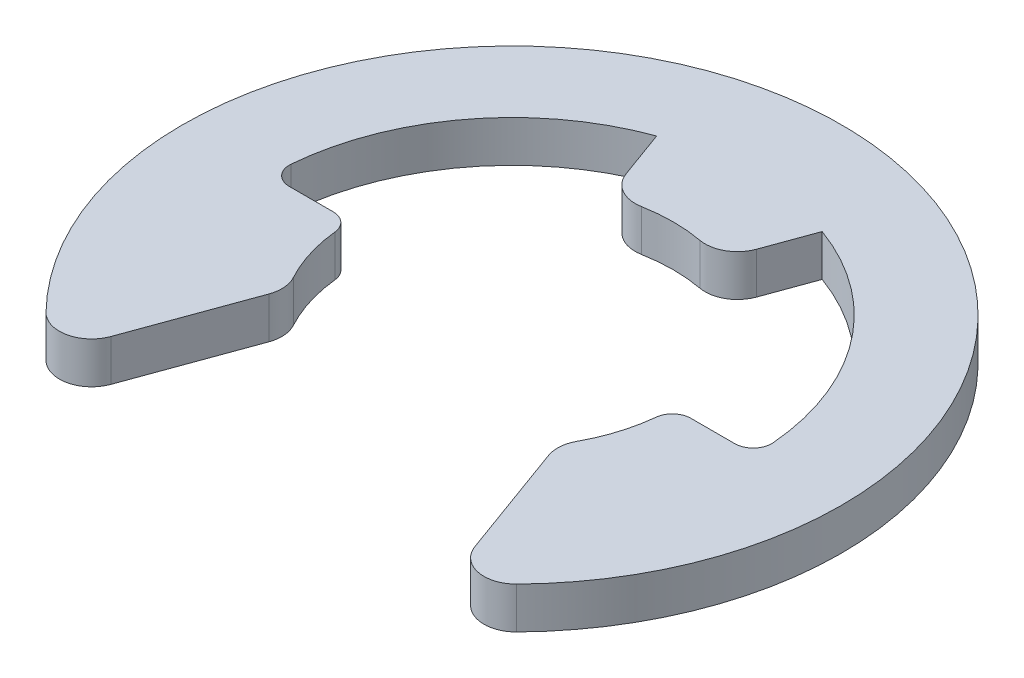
ISO-10303-21;
HEADER;
FILE_DESCRIPTION(('STEP AP214'),'2;1');
FILE_NAME('part.step','',(''),(''),'','','');
FILE_SCHEMA(('AUTOMOTIVE_DESIGN { 1 0 10303 214 1 1 1 1 }'));
ENDSEC;
DATA;
#1=APPLICATION_CONTEXT('core data for automotive mechanical design processes');
#2=APPLICATION_PROTOCOL_DEFINITION('international standard','automotive_design',2000,#1);
#3=PRODUCT_CONTEXT('',#1,'mechanical');
#4=PRODUCT('Part','Part','',(#3));
#5=PRODUCT_RELATED_PRODUCT_CATEGORY('part','',(#4));
#6=PRODUCT_DEFINITION_FORMATION('','',#4);
#7=PRODUCT_DEFINITION_CONTEXT('part definition',#1,'design');
#8=PRODUCT_DEFINITION('design','',#6,#7);
#9=PRODUCT_DEFINITION_SHAPE('','',#8);
#10=(LENGTH_UNIT() NAMED_UNIT(*) SI_UNIT(.MILLI.,.METRE.));
#11=(NAMED_UNIT(*) PLANE_ANGLE_UNIT() SI_UNIT($,.RADIAN.));
#12=(NAMED_UNIT(*) SI_UNIT($,.STERADIAN.) SOLID_ANGLE_UNIT());
#13=UNCERTAINTY_MEASURE_WITH_UNIT(LENGTH_MEASURE(1.E-05),#10,'distance_accuracy_value','');
#14=(GEOMETRIC_REPRESENTATION_CONTEXT(3) GLOBAL_UNCERTAINTY_ASSIGNED_CONTEXT((#13)) GLOBAL_UNIT_ASSIGNED_CONTEXT((#10,
#11,#12)) REPRESENTATION_CONTEXT('',''));
#15=CARTESIAN_POINT('',(0.,0.,0.));
#16=DIRECTION('',(0.,0.,1.));
#17=DIRECTION('',(1.,0.,0.));
#18=AXIS2_PLACEMENT_3D('',#15,#16,#17);
#19=CARTESIAN_POINT('',(0.,0.45,0.));
#20=DIRECTION('',(0.,-1.,0.));
#21=DIRECTION('',(0.,0.,-1.));
#22=AXIS2_PLACEMENT_3D('',#19,#20,#21);
#23=CYLINDRICAL_SURFACE('',#22,5.25);
#24=CARTESIAN_POINT('',(0.,0.45,0.));
#25=DIRECTION('',(0.,-1.,0.));
#26=DIRECTION('',(0.,0.,1.));
#27=AXIS2_PLACEMENT_3D('',#24,#25,#26);
#28=CIRCLE('',#27,5.25);
#29=CARTESIAN_POINT('',(-5.23211428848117,0.45,-0.43298969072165));
#30=VERTEX_POINT('',#29);
#31=CARTESIAN_POINT('',(-1.79560575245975,0.45,-4.93338625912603));
#32=VERTEX_POINT('',#31);
#33=EDGE_CURVE('E187',#30,#32,#28,.T.);
#34=ORIENTED_EDGE('',*,*,#33,.F.);
#35=DIRECTION('',(0.,-1.,0.));
#36=VECTOR('',#35,1.);
#37=CARTESIAN_POINT('',(-5.23211428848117,0.45,-0.43298969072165));
#38=LINE('',#37,#36);
#39=CARTESIAN_POINT('',(-5.23211428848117,-0.45,-0.43298969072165));
#40=VERTEX_POINT('',#39);
#41=EDGE_CURVE('E328',#30,#40,#38,.T.);
#42=ORIENTED_EDGE('',*,*,#41,.T.);
#43=CARTESIAN_POINT('',(0.,-0.45,0.));
#44=DIRECTION('',(0.,-1.,0.));
#45=DIRECTION('',(0.,0.,1.));
#46=AXIS2_PLACEMENT_3D('',#43,#44,#45);
#47=CIRCLE('',#46,5.25);
#48=CARTESIAN_POINT('',(-1.79560575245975,-0.45,-4.93338625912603));
#49=VERTEX_POINT('',#48);
#50=EDGE_CURVE('E211',#40,#49,#47,.T.);
#51=ORIENTED_EDGE('',*,*,#50,.T.);
#52=DIRECTION('',(0.,-1.,0.));
#53=VECTOR('',#52,1.);
#54=CARTESIAN_POINT('',(-1.79560575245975,0.45,-4.93338625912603));
#55=LINE('',#54,#53);
#56=EDGE_CURVE('E204',#32,#49,#55,.T.);
#57=ORIENTED_EDGE('',*,*,#56,.F.);
#58=EDGE_LOOP('',(#34,#42,#51,#57));
#59=FACE_BOUND('',#58,.T.);
#60=ADVANCED_FACE('F39',(#59),#23,.F.);
#61=CARTESIAN_POINT('',(-1.79560575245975,0.45,-4.93338625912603));
#62=DIRECTION('',(0.939692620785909,0.,-0.342020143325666));
#63=DIRECTION('',(-0.342020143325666,0.,-0.939692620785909));
#64=AXIS2_PLACEMENT_3D('',#61,#62,#63);
#65=PLANE('',#64);
#66=DIRECTION('',(0.342020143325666,0.,0.939692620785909));
#67=VECTOR('',#66,1.);
#68=CARTESIAN_POINT('',(-1.79560575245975,-0.45,-4.93338625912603));
#69=LINE('',#68,#67);
#70=CARTESIAN_POINT('',(-1.41639291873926,-0.45,-3.89150756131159));
#71=VERTEX_POINT('',#70);
#72=EDGE_CURVE('E447',#49,#71,#69,.T.);
#73=ORIENTED_EDGE('',*,*,#72,.T.);
#74=DIRECTION('',(0.,-1.,0.));
#75=VECTOR('',#74,1.);
#76=CARTESIAN_POINT('',(-1.41639291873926,0.45,-3.89150756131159));
#77=LINE('',#76,#75);
#78=CARTESIAN_POINT('',(-1.41639291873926,0.45,-3.89150756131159));
#79=VERTEX_POINT('',#78);
#80=EDGE_CURVE('E206',#71,#79,#77,.F.);
#81=ORIENTED_EDGE('',*,*,#80,.T.);
#82=DIRECTION('',(0.342020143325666,0.,0.939692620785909));
#83=VECTOR('',#82,1.);
#84=CARTESIAN_POINT('',(-1.79560575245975,0.45,-4.93338625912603));
#85=LINE('',#84,#83);
#86=EDGE_CURVE('E191',#32,#79,#85,.T.);
#87=ORIENTED_EDGE('',*,*,#86,.F.);
#88=ORIENTED_EDGE('',*,*,#56,.T.);
#89=EDGE_LOOP('',(#73,#81,#87,#88));
#90=FACE_BOUND('',#89,.T.);
#91=ADVANCED_FACE('F203',(#90),#65,.F.);
#92=CARTESIAN_POINT('',(0.,0.45,0.));
#93=DIRECTION('',(0.,-1.,0.));
#94=DIRECTION('',(0.,0.,-1.));
#95=AXIS2_PLACEMENT_3D('',#92,#93,#94);
#96=CYLINDRICAL_SURFACE('',#95,3.5);
#97=CARTESIAN_POINT('',(0.,-0.45,0.));
#98=DIRECTION('',(0.,-1.,0.));
#99=DIRECTION('',(0.,0.,1.));
#100=AXIS2_PLACEMENT_3D('',#97,#98,#99);
#101=CIRCLE('',#100,3.5);
#102=CARTESIAN_POINT('',(-0.632173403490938,-0.45,-3.44243471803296));
#103=VERTEX_POINT('',#102);
#104=CARTESIAN_POINT('',(0.632173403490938,-0.45,-3.44243471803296));
#105=VERTEX_POINT('',#104);
#106=EDGE_CURVE('E450',#103,#105,#101,.T.);
#107=ORIENTED_EDGE('',*,*,#106,.T.);
#108=DIRECTION('',(0.,-1.,0.));
#109=VECTOR('',#108,1.);
#110=CARTESIAN_POINT('',(0.632173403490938,0.45,-3.44243471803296));
#111=LINE('',#110,#109);
#112=CARTESIAN_POINT('',(0.632173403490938,0.45,-3.44243471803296));
#113=VERTEX_POINT('',#112);
#114=EDGE_CURVE('E291',#105,#113,#111,.F.);
#115=ORIENTED_EDGE('',*,*,#114,.T.);
#116=CARTESIAN_POINT('',(0.,0.45,0.));
#117=DIRECTION('',(0.,-1.,0.));
#118=DIRECTION('',(0.,0.,1.));
#119=AXIS2_PLACEMENT_3D('',#116,#117,#118);
#120=CIRCLE('',#119,3.5);
#121=CARTESIAN_POINT('',(-0.632173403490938,0.45,-3.44243471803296));
#122=VERTEX_POINT('',#121);
#123=EDGE_CURVE('E208',#122,#113,#120,.T.);
#124=ORIENTED_EDGE('',*,*,#123,.F.);
#125=DIRECTION('',(0.,-1.,0.));
#126=VECTOR('',#125,1.);
#127=CARTESIAN_POINT('',(-0.632173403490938,0.45,-3.44243471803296));
#128=LINE('',#127,#126);
#129=EDGE_CURVE('E287',#122,#103,#128,.T.);
#130=ORIENTED_EDGE('',*,*,#129,.T.);
#131=EDGE_LOOP('',(#107,#115,#124,#130));
#132=FACE_BOUND('',#131,.T.);
#133=ADVANCED_FACE('F372',(#132),#96,.F.);
#134=CARTESIAN_POINT('',(1.19707050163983,0.45,-3.28892417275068));
#135=DIRECTION('',(-0.93969262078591,0.,-0.342020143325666));
#136=DIRECTION('',(-0.342020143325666,0.,0.93969262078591));
#137=AXIS2_PLACEMENT_3D('',#134,#135,#136);
#138=PLANE('',#137);
#139=DIRECTION('',(0.342020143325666,0.,-0.93969262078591));
#140=VECTOR('',#139,1.);
#141=CARTESIAN_POINT('',(1.19707050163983,0.45,-3.28892417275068));
#142=LINE('',#141,#140);
#143=CARTESIAN_POINT('',(1.41639291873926,0.45,-3.89150756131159));
#144=VERTEX_POINT('',#143);
#145=CARTESIAN_POINT('',(1.79560575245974,0.45,-4.93338625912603));
#146=VERTEX_POINT('',#145);
#147=EDGE_CURVE('E425',#144,#146,#142,.T.);
#148=ORIENTED_EDGE('',*,*,#147,.F.);
#149=DIRECTION('',(0.,-1.,0.));
#150=VECTOR('',#149,1.);
#151=CARTESIAN_POINT('',(1.41639291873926,0.45,-3.89150756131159));
#152=LINE('',#151,#150);
#153=CARTESIAN_POINT('',(1.41639291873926,-0.45,-3.89150756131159));
#154=VERTEX_POINT('',#153);
#155=EDGE_CURVE('E283',#144,#154,#152,.T.);
#156=ORIENTED_EDGE('',*,*,#155,.T.);
#157=DIRECTION('',(0.342020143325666,0.,-0.93969262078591));
#158=VECTOR('',#157,1.);
#159=CARTESIAN_POINT('',(1.19707050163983,-0.45,-3.28892417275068));
#160=LINE('',#159,#158);
#161=CARTESIAN_POINT('',(1.79560575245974,-0.45,-4.93338625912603));
#162=VERTEX_POINT('',#161);
#163=EDGE_CURVE('E454',#154,#162,#160,.T.);
#164=ORIENTED_EDGE('',*,*,#163,.T.);
#165=DIRECTION('',(0.,-1.,0.));
#166=VECTOR('',#165,1.);
#167=CARTESIAN_POINT('',(1.79560575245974,0.45,-4.93338625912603));
#168=LINE('',#167,#166);
#169=EDGE_CURVE('E215',#146,#162,#168,.T.);
#170=ORIENTED_EDGE('',*,*,#169,.F.);
#171=EDGE_LOOP('',(#148,#156,#164,#170));
#172=FACE_BOUND('',#171,.T.);
#173=ADVANCED_FACE('F527',(#172),#138,.F.);
#174=CARTESIAN_POINT('',(0.,0.45,0.));
#175=DIRECTION('',(0.,-1.,0.));
#176=DIRECTION('',(0.,0.,-1.));
#177=AXIS2_PLACEMENT_3D('',#174,#175,#176);
#178=CYLINDRICAL_SURFACE('',#177,5.25);
#179=CARTESIAN_POINT('',(0.,-0.45,0.));
#180=DIRECTION('',(0.,-1.,0.));
#181=DIRECTION('',(0.,0.,1.));
#182=AXIS2_PLACEMENT_3D('',#179,#180,#181);
#183=CIRCLE('',#182,5.25);
#184=CARTESIAN_POINT('',(5.23211428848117,-0.45,-0.43298969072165));
#185=VERTEX_POINT('',#184);
#186=EDGE_CURVE('E457',#162,#185,#183,.T.);
#187=ORIENTED_EDGE('',*,*,#186,.T.);
#188=DIRECTION('',(0.,-1.,0.));
#189=VECTOR('',#188,1.);
#190=CARTESIAN_POINT('',(5.23211428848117,0.45,-0.43298969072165));
#191=LINE('',#190,#189);
#192=CARTESIAN_POINT('',(5.23211428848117,0.45,-0.43298969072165));
#193=VERTEX_POINT('',#192);
#194=EDGE_CURVE('E309',#185,#193,#191,.F.);
#195=ORIENTED_EDGE('',*,*,#194,.T.);
#196=CARTESIAN_POINT('',(0.,0.45,0.));
#197=DIRECTION('',(0.,-1.,0.));
#198=DIRECTION('',(0.,0.,1.));
#199=AXIS2_PLACEMENT_3D('',#196,#197,#198);
#200=CIRCLE('',#199,5.25);
#201=EDGE_CURVE('E412',#146,#193,#200,.T.);
#202=ORIENTED_EDGE('',*,*,#201,.F.);
#203=ORIENTED_EDGE('',*,*,#169,.T.);
#204=EDGE_LOOP('',(#187,#195,#202,#203));
#205=FACE_BOUND('',#204,.T.);
#206=ADVANCED_FACE('F521',(#205),#178,.F.);
#207=CARTESIAN_POINT('',(3.5,0.45,0.));
#208=DIRECTION('',(0.,0.,1.));
#209=DIRECTION('',(1.,0.,0.));
#210=AXIS2_PLACEMENT_3D('',#207,#208,#209);
#211=PLANE('',#210);
#212=DIRECTION('',(-1.,0.,0.));
#213=VECTOR('',#212,1.);
#214=CARTESIAN_POINT('',(3.5,0.45,0.));
#215=LINE('',#214,#213);
#216=CARTESIAN_POINT('',(4.83347700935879,0.45,0.));
#217=VERTEX_POINT('',#216);
#218=CARTESIAN_POINT('',(3.87943294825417,0.45,0.));
#219=VERTEX_POINT('',#218);
#220=EDGE_CURVE('E409',#217,#219,#215,.T.);
#221=ORIENTED_EDGE('',*,*,#220,.F.);
#222=DIRECTION('',(0.,1.,0.));
#223=VECTOR('',#222,1.);
#224=CARTESIAN_POINT('',(4.83347700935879,-0.45,0.));
#225=LINE('',#224,#223);
#226=CARTESIAN_POINT('',(4.83347700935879,-0.45,0.));
#227=VERTEX_POINT('',#226);
#228=EDGE_CURVE('E305',#217,#227,#225,.F.);
#229=ORIENTED_EDGE('',*,*,#228,.T.);
#230=DIRECTION('',(-1.,0.,0.));
#231=VECTOR('',#230,1.);
#232=CARTESIAN_POINT('',(3.5,-0.45,0.));
#233=LINE('',#232,#231);
#234=CARTESIAN_POINT('',(3.87943294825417,-0.45,0.));
#235=VERTEX_POINT('',#234);
#236=EDGE_CURVE('E461',#227,#235,#233,.T.);
#237=ORIENTED_EDGE('',*,*,#236,.T.);
#238=DIRECTION('',(0.,-1.,0.));
#239=VECTOR('',#238,1.);
#240=CARTESIAN_POINT('',(3.87943294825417,0.45,0.));
#241=LINE('',#240,#239);
#242=EDGE_CURVE('E302',#235,#219,#241,.F.);
#243=ORIENTED_EDGE('',*,*,#242,.T.);
#244=EDGE_LOOP('',(#221,#229,#237,#243));
#245=FACE_BOUND('',#244,.T.);
#246=ADVANCED_FACE('F414',(#245),#211,.F.);
#247=CARTESIAN_POINT('',(0.,0.45,0.));
#248=DIRECTION('',(0.,-1.,0.));
#249=DIRECTION('',(0.,0.,-1.));
#250=AXIS2_PLACEMENT_3D('',#247,#248,#249);
#251=CYLINDRICAL_SURFACE('',#250,3.5);
#252=CARTESIAN_POINT('',(0.,0.45,0.));
#253=DIRECTION('',(0.,-1.,0.));
#254=DIRECTION('',(0.,0.,1.));
#255=AXIS2_PLACEMENT_3D('',#252,#253,#254);
#256=CIRCLE('',#255,3.5);
#257=CARTESIAN_POINT('',(3.48154238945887,0.45,0.358974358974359));
#258=VERTEX_POINT('',#257);
#259=CARTESIAN_POINT('',(3.07634538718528,0.45,1.66916118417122));
#260=VERTEX_POINT('',#259);
#261=EDGE_CURVE('E419',#258,#260,#256,.T.);
#262=ORIENTED_EDGE('',*,*,#261,.F.);
#263=DIRECTION('',(0.,-1.,0.));
#264=VECTOR('',#263,1.);
#265=CARTESIAN_POINT('',(3.48154238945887,0.45,0.358974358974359));
#266=LINE('',#265,#264);
#267=CARTESIAN_POINT('',(3.48154238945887,-0.45,0.358974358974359));
#268=VERTEX_POINT('',#267);
#269=EDGE_CURVE('E312',#258,#268,#266,.T.);
#270=ORIENTED_EDGE('',*,*,#269,.T.);
#271=CARTESIAN_POINT('',(0.,-0.45,0.));
#272=DIRECTION('',(0.,-1.,0.));
#273=DIRECTION('',(0.,0.,1.));
#274=AXIS2_PLACEMENT_3D('',#271,#272,#273);
#275=CIRCLE('',#274,3.5);
#276=CARTESIAN_POINT('',(3.07634538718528,-0.45,1.66916118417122));
#277=VERTEX_POINT('',#276);
#278=EDGE_CURVE('E463',#268,#277,#275,.T.);
#279=ORIENTED_EDGE('',*,*,#278,.T.);
#280=DIRECTION('',(0.,-1.,0.));
#281=VECTOR('',#280,1.);
#282=CARTESIAN_POINT('',(3.07634538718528,0.45,1.66916118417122));
#283=LINE('',#282,#281);
#284=EDGE_CURVE('E250',#277,#260,#283,.F.);
#285=ORIENTED_EDGE('',*,*,#284,.T.);
#286=EDGE_LOOP('',(#262,#270,#279,#285));
#287=FACE_BOUND('',#286,.T.);
#288=ADVANCED_FACE('F512',(#287),#251,.F.);
#289=CARTESIAN_POINT('',(2.91999999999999,0.45,1.92966318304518));
#290=DIRECTION('',(0.939692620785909,0.,-0.342020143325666));
#291=DIRECTION('',(-0.342020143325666,0.,-0.93969262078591));
#292=AXIS2_PLACEMENT_3D('',#289,#290,#291);
#293=PLANE('',#292);
#294=DIRECTION('',(0.342020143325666,0.,0.939692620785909));
#295=VECTOR('',#294,1.);
#296=CARTESIAN_POINT('',(2.91999999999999,0.45,1.92966318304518));
#297=LINE('',#296,#295);
#298=CARTESIAN_POINT('',(3.0338296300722,0.45,2.24240752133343));
#299=VERTEX_POINT('',#298);
#300=CARTESIAN_POINT('',(3.94820952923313,0.45,4.75464564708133));
#301=VERTEX_POINT('',#300);
#302=EDGE_CURVE('E422',#299,#301,#297,.T.);
#303=ORIENTED_EDGE('',*,*,#302,.F.);
#304=DIRECTION('',(0.,-1.,0.));
#305=VECTOR('',#304,1.);
#306=CARTESIAN_POINT('',(3.0338296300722,0.45,2.24240752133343));
#307=LINE('',#306,#305);
#308=CARTESIAN_POINT('',(3.0338296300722,-0.45,2.24240752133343));
#309=VERTEX_POINT('',#308);
#310=EDGE_CURVE('E220',#299,#309,#307,.T.);
#311=ORIENTED_EDGE('',*,*,#310,.T.);
#312=DIRECTION('',(0.342020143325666,0.,0.939692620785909));
#313=VECTOR('',#312,1.);
#314=CARTESIAN_POINT('',(2.91999999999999,-0.45,1.92966318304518));
#315=LINE('',#314,#313);
#316=CARTESIAN_POINT('',(3.94820952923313,-0.45,4.75464564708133));
#317=VERTEX_POINT('',#316);
#318=EDGE_CURVE('E466',#309,#317,#315,.T.);
#319=ORIENTED_EDGE('',*,*,#318,.T.);
#320=DIRECTION('',(0.,-1.,0.));
#321=VECTOR('',#320,1.);
#322=CARTESIAN_POINT('',(3.94820952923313,0.45,4.75464564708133));
#323=LINE('',#322,#321);
#324=EDGE_CURVE('E214',#317,#301,#323,.F.);
#325=ORIENTED_EDGE('',*,*,#324,.T.);
#326=EDGE_LOOP('',(#303,#311,#319,#325));
#327=FACE_BOUND('',#326,.T.);
#328=ADVANCED_FACE('F506',(#327),#293,.F.);
#329=CARTESIAN_POINT('',(0.,0.45,0.));
#330=DIRECTION('',(0.,-1.,0.));
#331=DIRECTION('',(0.,0.,-1.));
#332=AXIS2_PLACEMENT_3D('',#329,#330,#331);
#333=CYLINDRICAL_SURFACE('',#332,7.15);
#334=CARTESIAN_POINT('',(0.,0.45,0.));
#335=DIRECTION('',(0.,1.,0.));
#336=DIRECTION('',(0.,0.,1.));
#337=AXIS2_PLACEMENT_3D('',#334,#335,#336);
#338=CIRCLE('',#337,7.15);
#339=CARTESIAN_POINT('',(5.10586972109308,0.45,5.00525667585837));
#340=VERTEX_POINT('',#339);
#341=CARTESIAN_POINT('',(-5.10586972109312,0.45,5.00525667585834));
#342=VERTEX_POINT('',#341);
#343=EDGE_CURVE('E432',#340,#342,#338,.T.);
#344=ORIENTED_EDGE('',*,*,#343,.F.);
#345=DIRECTION('',(0.,-1.,0.));
#346=VECTOR('',#345,1.);
#347=CARTESIAN_POINT('',(5.10586972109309,0.45,5.00525667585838));
#348=LINE('',#347,#346);
#349=CARTESIAN_POINT('',(5.10586972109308,-0.45,5.00525667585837));
#350=VERTEX_POINT('',#349);
#351=EDGE_CURVE('E298',#340,#350,#348,.T.);
#352=ORIENTED_EDGE('',*,*,#351,.T.);
#353=CARTESIAN_POINT('',(0.,-0.45,0.));
#354=DIRECTION('',(0.,1.,0.));
#355=DIRECTION('',(0.,0.,1.));
#356=AXIS2_PLACEMENT_3D('',#353,#354,#355);
#357=CIRCLE('',#356,7.15);
#358=CARTESIAN_POINT('',(-5.10586972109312,-0.45,5.00525667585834));
#359=VERTEX_POINT('',#358);
#360=EDGE_CURVE('E470',#350,#359,#357,.T.);
#361=ORIENTED_EDGE('',*,*,#360,.T.);
#362=DIRECTION('',(0.,-1.,0.));
#363=VECTOR('',#362,1.);
#364=CARTESIAN_POINT('',(-5.10586972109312,0.45,5.00525667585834));
#365=LINE('',#364,#363);
#366=EDGE_CURVE('E296',#359,#342,#365,.F.);
#367=ORIENTED_EDGE('',*,*,#366,.T.);
#368=EDGE_LOOP('',(#344,#352,#361,#367));
#369=FACE_BOUND('',#368,.T.);
#370=ADVANCED_FACE('F499',(#369),#333,.T.);
#371=CARTESIAN_POINT('',(-4.29751542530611,0.45,5.71435570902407));
#372=DIRECTION('',(-0.939692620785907,0.,-0.342020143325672));
#373=DIRECTION('',(-0.342020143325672,0.,0.939692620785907));
#374=AXIS2_PLACEMENT_3D('',#371,#372,#373);
#375=PLANE('',#374);
#376=DIRECTION('',(0.342020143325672,0.,-0.939692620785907));
#377=VECTOR('',#376,1.);
#378=CARTESIAN_POINT('',(-4.29751542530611,-0.45,5.71435570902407));
#379=LINE('',#378,#377);
#380=CARTESIAN_POINT('',(-3.94820952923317,-0.45,4.7546456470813));
#381=VERTEX_POINT('',#380);
#382=CARTESIAN_POINT('',(-3.03382963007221,-0.45,2.24240752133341));
#383=VERTEX_POINT('',#382);
#384=EDGE_CURVE('E474',#381,#383,#379,.T.);
#385=ORIENTED_EDGE('',*,*,#384,.T.);
#386=DIRECTION('',(0.,-1.,0.));
#387=VECTOR('',#386,1.);
#388=CARTESIAN_POINT('',(-3.03382963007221,0.45,2.24240752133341));
#389=LINE('',#388,#387);
#390=CARTESIAN_POINT('',(-3.03382963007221,0.45,2.24240752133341));
#391=VERTEX_POINT('',#390);
#392=EDGE_CURVE('E280',#383,#391,#389,.F.);
#393=ORIENTED_EDGE('',*,*,#392,.T.);
#394=DIRECTION('',(0.342020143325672,0.,-0.939692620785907));
#395=VECTOR('',#394,1.);
#396=CARTESIAN_POINT('',(-4.29751542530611,0.45,5.71435570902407));
#397=LINE('',#396,#395);
#398=CARTESIAN_POINT('',(-3.94820952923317,0.45,4.7546456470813));
#399=VERTEX_POINT('',#398);
#400=EDGE_CURVE('E436',#399,#391,#397,.T.);
#401=ORIENTED_EDGE('',*,*,#400,.F.);
#402=DIRECTION('',(0.,-1.,0.));
#403=VECTOR('',#402,1.);
#404=CARTESIAN_POINT('',(-3.94820952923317,0.45,4.7546456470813));
#405=LINE('',#404,#403);
#406=EDGE_CURVE('E276',#399,#381,#405,.T.);
#407=ORIENTED_EDGE('',*,*,#406,.T.);
#408=EDGE_LOOP('',(#385,#393,#401,#407));
#409=FACE_BOUND('',#408,.T.);
#410=ADVANCED_FACE('F491',(#409),#375,.F.);
#411=CARTESIAN_POINT('',(0.,0.45,0.));
#412=DIRECTION('',(0.,-1.,0.));
#413=DIRECTION('',(0.,0.,-1.));
#414=AXIS2_PLACEMENT_3D('',#411,#412,#413);
#415=CYLINDRICAL_SURFACE('',#414,3.5);
#416=CARTESIAN_POINT('',(0.,-0.45,0.));
#417=DIRECTION('',(0.,-1.,0.));
#418=DIRECTION('',(0.,0.,1.));
#419=AXIS2_PLACEMENT_3D('',#416,#417,#418);
#420=CIRCLE('',#419,3.5);
#421=CARTESIAN_POINT('',(-3.07634538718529,-0.45,1.6691611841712));
#422=VERTEX_POINT('',#421);
#423=CARTESIAN_POINT('',(-3.48154238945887,-0.45,0.358974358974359));
#424=VERTEX_POINT('',#423);
#425=EDGE_CURVE('E355',#422,#424,#420,.T.);
#426=ORIENTED_EDGE('',*,*,#425,.T.);
#427=DIRECTION('',(0.,-1.,0.));
#428=VECTOR('',#427,1.);
#429=CARTESIAN_POINT('',(-3.48154238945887,0.45,0.358974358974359));
#430=LINE('',#429,#428);
#431=CARTESIAN_POINT('',(-3.48154238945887,0.45,0.358974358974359));
#432=VERTEX_POINT('',#431);
#433=EDGE_CURVE('E337',#424,#432,#430,.F.);
#434=ORIENTED_EDGE('',*,*,#433,.T.);
#435=CARTESIAN_POINT('',(0.,0.45,0.));
#436=DIRECTION('',(0.,-1.,0.));
#437=DIRECTION('',(0.,0.,1.));
#438=AXIS2_PLACEMENT_3D('',#435,#436,#437);
#439=CIRCLE('',#438,3.5);
#440=CARTESIAN_POINT('',(-3.07634538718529,0.45,1.6691611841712));
#441=VERTEX_POINT('',#440);
#442=EDGE_CURVE('E440',#441,#432,#439,.T.);
#443=ORIENTED_EDGE('',*,*,#442,.F.);
#444=DIRECTION('',(0.,-1.,0.));
#445=VECTOR('',#444,1.);
#446=CARTESIAN_POINT('',(-3.07634538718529,0.45,1.6691611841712));
#447=LINE('',#446,#445);
#448=EDGE_CURVE('E272',#441,#422,#447,.T.);
#449=ORIENTED_EDGE('',*,*,#448,.T.);
#450=EDGE_LOOP('',(#426,#434,#443,#449));
#451=FACE_BOUND('',#450,.T.);
#452=ADVANCED_FACE('F483',(#451),#415,.F.);
#453=CARTESIAN_POINT('',(-3.5,0.45,0.));
#454=DIRECTION('',(0.,0.,1.));
#455=DIRECTION('',(1.,0.,0.));
#456=AXIS2_PLACEMENT_3D('',#453,#454,#455);
#457=PLANE('',#456);
#458=DIRECTION('',(-1.,0.,0.));
#459=VECTOR('',#458,1.);
#460=CARTESIAN_POINT('',(-3.5,-0.45,0.));
#461=LINE('',#460,#459);
#462=CARTESIAN_POINT('',(-3.87943294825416,-0.45,0.));
#463=VERTEX_POINT('',#462);
#464=CARTESIAN_POINT('',(-4.83347700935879,-0.45,0.));
#465=VERTEX_POINT('',#464);
#466=EDGE_CURVE('E198',#463,#465,#461,.T.);
#467=ORIENTED_EDGE('',*,*,#466,.T.);
#468=DIRECTION('',(0.,1.,0.));
#469=VECTOR('',#468,1.);
#470=CARTESIAN_POINT('',(-4.83347700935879,0.45,0.));
#471=LINE('',#470,#469);
#472=CARTESIAN_POINT('',(-4.83347700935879,0.45,0.));
#473=VERTEX_POINT('',#472);
#474=EDGE_CURVE('E61',#465,#473,#471,.T.);
#475=ORIENTED_EDGE('',*,*,#474,.T.);
#476=DIRECTION('',(-1.,0.,0.));
#477=VECTOR('',#476,1.);
#478=CARTESIAN_POINT('',(-3.5,0.45,0.));
#479=LINE('',#478,#477);
#480=CARTESIAN_POINT('',(-3.87943294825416,0.45,0.));
#481=VERTEX_POINT('',#480);
#482=EDGE_CURVE('E224',#481,#473,#479,.T.);
#483=ORIENTED_EDGE('',*,*,#482,.F.);
#484=DIRECTION('',(0.,-1.,0.));
#485=VECTOR('',#484,1.);
#486=CARTESIAN_POINT('',(-3.87943294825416,0.45,0.));
#487=LINE('',#486,#485);
#488=EDGE_CURVE('E331',#481,#463,#487,.T.);
#489=ORIENTED_EDGE('',*,*,#488,.T.);
#490=EDGE_LOOP('',(#467,#475,#483,#489));
#491=FACE_BOUND('',#490,.T.);
#492=ADVANCED_FACE('F352',(#491),#457,.F.);
#493=CARTESIAN_POINT('',(0.,0.45,0.));
#494=DIRECTION('',(0.,1.,0.));
#495=DIRECTION('',(0.,0.,1.));
#496=AXIS2_PLACEMENT_3D('',#493,#494,#495);
#497=PLANE('',#496);
#498=ORIENTED_EDGE('',*,*,#220,.T.);
#499=CARTESIAN_POINT('',(3.87943294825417,0.45,0.4));
#500=DIRECTION('',(0.,1.,0.));
#501=DIRECTION('',(0.,0.,1.));
#502=AXIS2_PLACEMENT_3D('',#499,#500,#501);
#503=CIRCLE('',#502,0.4);
#504=EDGE_CURVE('E325',#219,#258,#503,.T.);
#505=ORIENTED_EDGE('',*,*,#504,.T.);
#506=ORIENTED_EDGE('',*,*,#261,.T.);
#507=CARTESIAN_POINT('',(3.69161446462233,0.45,2.00299342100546));
#508=DIRECTION('',(0.,1.,0.));
#509=DIRECTION('',(0.,0.,1.));
#510=AXIS2_PLACEMENT_3D('',#507,#508,#509);
#511=CIRCLE('',#510,0.7);
#512=EDGE_CURVE('E269',#260,#299,#511,.T.);
#513=ORIENTED_EDGE('',*,*,#512,.T.);
#514=ORIENTED_EDGE('',*,*,#302,.T.);
#515=CARTESIAN_POINT('',(4.60599436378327,0.45,4.51523154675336));
#516=DIRECTION('',(0.,1.,0.));
#517=DIRECTION('',(0.,0.,1.));
#518=AXIS2_PLACEMENT_3D('',#515,#516,#517);
#519=CIRCLE('',#518,0.7);
#520=EDGE_CURVE('E257',#301,#340,#519,.T.);
#521=ORIENTED_EDGE('',*,*,#520,.T.);
#522=ORIENTED_EDGE('',*,*,#343,.T.);
#523=CARTESIAN_POINT('',(-4.6059943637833,0.45,4.51523154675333));
#524=DIRECTION('',(0.,1.,0.));
#525=DIRECTION('',(0.,0.,1.));
#526=AXIS2_PLACEMENT_3D('',#523,#524,#525);
#527=CIRCLE('',#526,0.7);
#528=EDGE_CURVE('E254',#342,#399,#527,.T.);
#529=ORIENTED_EDGE('',*,*,#528,.T.);
#530=ORIENTED_EDGE('',*,*,#400,.T.);
#531=CARTESIAN_POINT('',(-3.69161446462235,0.45,2.00299342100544));
#532=DIRECTION('',(0.,1.,0.));
#533=DIRECTION('',(0.,0.,1.));
#534=AXIS2_PLACEMENT_3D('',#531,#532,#533);
#535=CIRCLE('',#534,0.7);
#536=EDGE_CURVE('E266',#391,#441,#535,.T.);
#537=ORIENTED_EDGE('',*,*,#536,.T.);
#538=ORIENTED_EDGE('',*,*,#442,.T.);
#539=CARTESIAN_POINT('',(-3.87943294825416,0.45,0.4));
#540=DIRECTION('',(0.,1.,0.));
#541=DIRECTION('',(0.,0.,1.));
#542=AXIS2_PLACEMENT_3D('',#539,#540,#541);
#543=CIRCLE('',#542,0.4);
#544=EDGE_CURVE('E322',#432,#481,#543,.T.);
#545=ORIENTED_EDGE('',*,*,#544,.T.);
#546=ORIENTED_EDGE('',*,*,#482,.T.);
#547=CARTESIAN_POINT('',(-4.83347700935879,0.45,-0.4));
#548=DIRECTION('',(0.,1.,0.));
#549=DIRECTION('',(0.,0.,1.));
#550=AXIS2_PLACEMENT_3D('',#547,#548,#549);
#551=CIRCLE('',#550,0.4);
#552=EDGE_CURVE('E11',#473,#30,#551,.F.);
#553=ORIENTED_EDGE('',*,*,#552,.T.);
#554=ORIENTED_EDGE('',*,*,#33,.T.);
#555=ORIENTED_EDGE('',*,*,#86,.T.);
#556=CARTESIAN_POINT('',(-0.758608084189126,0.45,-4.13092166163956));
#557=DIRECTION('',(0.,1.,0.));
#558=DIRECTION('',(0.,0.,1.));
#559=AXIS2_PLACEMENT_3D('',#556,#557,#558);
#560=CIRCLE('',#559,0.7);
#561=EDGE_CURVE('E260',#79,#122,#560,.T.);
#562=ORIENTED_EDGE('',*,*,#561,.T.);
#563=ORIENTED_EDGE('',*,*,#123,.T.);
#564=CARTESIAN_POINT('',(0.758608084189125,0.45,-4.13092166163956));
#565=DIRECTION('',(0.,1.,0.));
#566=DIRECTION('',(0.,0.,1.));
#567=AXIS2_PLACEMENT_3D('',#564,#565,#566);
#568=CIRCLE('',#567,0.7);
#569=EDGE_CURVE('E263',#113,#144,#568,.T.);
#570=ORIENTED_EDGE('',*,*,#569,.T.);
#571=ORIENTED_EDGE('',*,*,#147,.T.);
#572=ORIENTED_EDGE('',*,*,#201,.T.);
#573=CARTESIAN_POINT('',(4.83347700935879,0.45,-0.4));
#574=DIRECTION('',(0.,1.,0.));
#575=DIRECTION('',(0.,0.,1.));
#576=AXIS2_PLACEMENT_3D('',#573,#574,#575);
#577=CIRCLE('',#576,0.4);
#578=EDGE_CURVE('E343',#193,#217,#577,.F.);
#579=ORIENTED_EDGE('',*,*,#578,.T.);
#580=EDGE_LOOP('',(#498,#505,#506,#513,#514,#521,#522,#529,#530,#537,#538,#545,#546,#553,#554,
#555,#562,#563,#570,#571,#572,#579));
#581=FACE_BOUND('',#580,.T.);
#582=ADVANCED_FACE('F190',(#581),#497,.T.);
#583=CARTESIAN_POINT('',(0.,-0.45,0.));
#584=DIRECTION('',(0.,1.,0.));
#585=DIRECTION('',(0.,0.,1.));
#586=AXIS2_PLACEMENT_3D('',#583,#584,#585);
#587=PLANE('',#586);
#588=ORIENTED_EDGE('',*,*,#278,.F.);
#589=CARTESIAN_POINT('',(3.87943294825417,-0.45,0.4));
#590=DIRECTION('',(0.,1.,0.));
#591=DIRECTION('',(0.,0.,1.));
#592=AXIS2_PLACEMENT_3D('',#589,#590,#591);
#593=CIRCLE('',#592,0.4);
#594=EDGE_CURVE('E319',#268,#235,#593,.F.);
#595=ORIENTED_EDGE('',*,*,#594,.T.);
#596=ORIENTED_EDGE('',*,*,#236,.F.);
#597=CARTESIAN_POINT('',(4.83347700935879,-0.45,-0.4));
#598=DIRECTION('',(0.,1.,0.));
#599=DIRECTION('',(0.,0.,1.));
#600=AXIS2_PLACEMENT_3D('',#597,#598,#599);
#601=CIRCLE('',#600,0.4);
#602=EDGE_CURVE('E340',#227,#185,#601,.T.);
#603=ORIENTED_EDGE('',*,*,#602,.T.);
#604=ORIENTED_EDGE('',*,*,#186,.F.);
#605=ORIENTED_EDGE('',*,*,#163,.F.);
#606=CARTESIAN_POINT('',(0.758608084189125,-0.45,-4.13092166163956));
#607=DIRECTION('',(0.,1.,0.));
#608=DIRECTION('',(0.,0.,1.));
#609=AXIS2_PLACEMENT_3D('',#606,#607,#608);
#610=CIRCLE('',#609,0.7);
#611=EDGE_CURVE('E240',#154,#105,#610,.F.);
#612=ORIENTED_EDGE('',*,*,#611,.T.);
#613=ORIENTED_EDGE('',*,*,#106,.F.);
#614=CARTESIAN_POINT('',(-0.758608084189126,-0.45,-4.13092166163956));
#615=DIRECTION('',(0.,1.,0.));
#616=DIRECTION('',(0.,0.,1.));
#617=AXIS2_PLACEMENT_3D('',#614,#615,#616);
#618=CIRCLE('',#617,0.7);
#619=EDGE_CURVE('E237',#103,#71,#618,.F.);
#620=ORIENTED_EDGE('',*,*,#619,.T.);
#621=ORIENTED_EDGE('',*,*,#72,.F.);
#622=ORIENTED_EDGE('',*,*,#50,.F.);
#623=CARTESIAN_POINT('',(-4.83347700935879,-0.45,-0.4));
#624=DIRECTION('',(0.,1.,0.));
#625=DIRECTION('',(0.,0.,1.));
#626=AXIS2_PLACEMENT_3D('',#623,#624,#625);
#627=CIRCLE('',#626,0.4);
#628=EDGE_CURVE('E48',#40,#465,#627,.T.);
#629=ORIENTED_EDGE('',*,*,#628,.T.);
#630=ORIENTED_EDGE('',*,*,#466,.F.);
#631=CARTESIAN_POINT('',(-3.87943294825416,-0.45,0.4));
#632=DIRECTION('',(0.,1.,0.));
#633=DIRECTION('',(0.,0.,1.));
#634=AXIS2_PLACEMENT_3D('',#631,#632,#633);
#635=CIRCLE('',#634,0.4);
#636=EDGE_CURVE('E316',#463,#424,#635,.F.);
#637=ORIENTED_EDGE('',*,*,#636,.T.);
#638=ORIENTED_EDGE('',*,*,#425,.F.);
#639=CARTESIAN_POINT('',(-3.69161446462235,-0.45,2.00299342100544));
#640=DIRECTION('',(0.,1.,0.));
#641=DIRECTION('',(0.,0.,1.));
#642=AXIS2_PLACEMENT_3D('',#639,#640,#641);
#643=CIRCLE('',#642,0.7);
#644=EDGE_CURVE('E243',#422,#383,#643,.F.);
#645=ORIENTED_EDGE('',*,*,#644,.T.);
#646=ORIENTED_EDGE('',*,*,#384,.F.);
#647=CARTESIAN_POINT('',(-4.6059943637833,-0.45,4.51523154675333));
#648=DIRECTION('',(0.,1.,0.));
#649=DIRECTION('',(0.,0.,1.));
#650=AXIS2_PLACEMENT_3D('',#647,#648,#649);
#651=CIRCLE('',#650,0.7);
#652=EDGE_CURVE('E231',#381,#359,#651,.F.);
#653=ORIENTED_EDGE('',*,*,#652,.T.);
#654=ORIENTED_EDGE('',*,*,#360,.F.);
#655=CARTESIAN_POINT('',(4.60599436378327,-0.45,4.51523154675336));
#656=DIRECTION('',(0.,1.,0.));
#657=DIRECTION('',(0.,0.,1.));
#658=AXIS2_PLACEMENT_3D('',#655,#656,#657);
#659=CIRCLE('',#658,0.7);
#660=EDGE_CURVE('E234',#350,#317,#659,.F.);
#661=ORIENTED_EDGE('',*,*,#660,.T.);
#662=ORIENTED_EDGE('',*,*,#318,.F.);
#663=CARTESIAN_POINT('',(3.69161446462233,-0.45,2.00299342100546));
#664=DIRECTION('',(0.,1.,0.));
#665=DIRECTION('',(0.,0.,1.));
#666=AXIS2_PLACEMENT_3D('',#663,#664,#665);
#667=CIRCLE('',#666,0.7);
#668=EDGE_CURVE('E246',#309,#277,#667,.F.);
#669=ORIENTED_EDGE('',*,*,#668,.T.);
#670=EDGE_LOOP('',(#588,#595,#596,#603,#604,#605,#612,#613,#620,#621,#622,#629,#630,#637,#638,
#645,#646,#653,#654,#661,#662,#669));
#671=FACE_BOUND('',#670,.T.);
#672=ADVANCED_FACE('F350',(#671),#587,.F.);
#673=CARTESIAN_POINT('',(3.69161446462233,0.45,2.00299342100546));
#674=DIRECTION('',(0.,-1.,0.));
#675=DIRECTION('',(0.,0.,-1.));
#676=AXIS2_PLACEMENT_3D('',#673,#674,#675);
#677=CYLINDRICAL_SURFACE('',#676,0.7);
#678=ORIENTED_EDGE('',*,*,#512,.F.);
#679=ORIENTED_EDGE('',*,*,#284,.F.);
#680=ORIENTED_EDGE('',*,*,#668,.F.);
#681=ORIENTED_EDGE('',*,*,#310,.F.);
#682=EDGE_LOOP('',(#678,#679,#680,#681));
#683=FACE_BOUND('',#682,.T.);
#684=ADVANCED_FACE('F376',(#683),#677,.T.);
#685=CARTESIAN_POINT('',(-3.69161446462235,0.45,2.00299342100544));
#686=DIRECTION('',(0.,-1.,0.));
#687=DIRECTION('',(0.,0.,-1.));
#688=AXIS2_PLACEMENT_3D('',#685,#686,#687);
#689=CYLINDRICAL_SURFACE('',#688,0.7);
#690=ORIENTED_EDGE('',*,*,#536,.F.);
#691=ORIENTED_EDGE('',*,*,#392,.F.);
#692=ORIENTED_EDGE('',*,*,#644,.F.);
#693=ORIENTED_EDGE('',*,*,#448,.F.);
#694=EDGE_LOOP('',(#690,#691,#692,#693));
#695=FACE_BOUND('',#694,.T.);
#696=ADVANCED_FACE('F379',(#695),#689,.T.);
#697=CARTESIAN_POINT('',(0.758608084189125,0.45,-4.13092166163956));
#698=DIRECTION('',(0.,-1.,0.));
#699=DIRECTION('',(0.,0.,-1.));
#700=AXIS2_PLACEMENT_3D('',#697,#698,#699);
#701=CYLINDRICAL_SURFACE('',#700,0.7);
#702=ORIENTED_EDGE('',*,*,#569,.F.);
#703=ORIENTED_EDGE('',*,*,#114,.F.);
#704=ORIENTED_EDGE('',*,*,#611,.F.);
#705=ORIENTED_EDGE('',*,*,#155,.F.);
#706=EDGE_LOOP('',(#702,#703,#704,#705));
#707=FACE_BOUND('',#706,.T.);
#708=ADVANCED_FACE('F383',(#707),#701,.T.);
#709=CARTESIAN_POINT('',(-0.758608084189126,0.45,-4.13092166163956));
#710=DIRECTION('',(0.,-1.,0.));
#711=DIRECTION('',(0.,0.,-1.));
#712=AXIS2_PLACEMENT_3D('',#709,#710,#711);
#713=CYLINDRICAL_SURFACE('',#712,0.7);
#714=ORIENTED_EDGE('',*,*,#561,.F.);
#715=ORIENTED_EDGE('',*,*,#80,.F.);
#716=ORIENTED_EDGE('',*,*,#619,.F.);
#717=ORIENTED_EDGE('',*,*,#129,.F.);
#718=EDGE_LOOP('',(#714,#715,#716,#717));
#719=FACE_BOUND('',#718,.T.);
#720=ADVANCED_FACE('F387',(#719),#713,.T.);
#721=CARTESIAN_POINT('',(4.60599436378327,0.45,4.51523154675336));
#722=DIRECTION('',(0.,-1.,0.));
#723=DIRECTION('',(0.,0.,-1.));
#724=AXIS2_PLACEMENT_3D('',#721,#722,#723);
#725=CYLINDRICAL_SURFACE('',#724,0.7);
#726=ORIENTED_EDGE('',*,*,#520,.F.);
#727=ORIENTED_EDGE('',*,*,#324,.F.);
#728=ORIENTED_EDGE('',*,*,#660,.F.);
#729=ORIENTED_EDGE('',*,*,#351,.F.);
#730=EDGE_LOOP('',(#726,#727,#728,#729));
#731=FACE_BOUND('',#730,.T.);
#732=ADVANCED_FACE('F391',(#731),#725,.T.);
#733=CARTESIAN_POINT('',(-4.6059943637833,0.45,4.51523154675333));
#734=DIRECTION('',(0.,-1.,0.));
#735=DIRECTION('',(0.,0.,-1.));
#736=AXIS2_PLACEMENT_3D('',#733,#734,#735);
#737=CYLINDRICAL_SURFACE('',#736,0.7);
#738=ORIENTED_EDGE('',*,*,#528,.F.);
#739=ORIENTED_EDGE('',*,*,#366,.F.);
#740=ORIENTED_EDGE('',*,*,#652,.F.);
#741=ORIENTED_EDGE('',*,*,#406,.F.);
#742=EDGE_LOOP('',(#738,#739,#740,#741));
#743=FACE_BOUND('',#742,.T.);
#744=ADVANCED_FACE('F395',(#743),#737,.T.);
#745=CARTESIAN_POINT('',(4.83347700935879,0.45,-0.4));
#746=DIRECTION('',(0.,-1.,0.));
#747=DIRECTION('',(0.,0.,-1.));
#748=AXIS2_PLACEMENT_3D('',#745,#746,#747);
#749=CYLINDRICAL_SURFACE('',#748,0.4);
#750=ORIENTED_EDGE('',*,*,#578,.F.);
#751=ORIENTED_EDGE('',*,*,#194,.F.);
#752=ORIENTED_EDGE('',*,*,#602,.F.);
#753=ORIENTED_EDGE('',*,*,#228,.F.);
#754=EDGE_LOOP('',(#750,#751,#752,#753));
#755=FACE_BOUND('',#754,.T.);
#756=ADVANCED_FACE('F364',(#755),#749,.F.);
#757=CARTESIAN_POINT('',(3.87943294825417,0.45,0.4));
#758=DIRECTION('',(0.,-1.,0.));
#759=DIRECTION('',(0.,0.,-1.));
#760=AXIS2_PLACEMENT_3D('',#757,#758,#759);
#761=CYLINDRICAL_SURFACE('',#760,0.4);
#762=ORIENTED_EDGE('',*,*,#504,.F.);
#763=ORIENTED_EDGE('',*,*,#242,.F.);
#764=ORIENTED_EDGE('',*,*,#594,.F.);
#765=ORIENTED_EDGE('',*,*,#269,.F.);
#766=EDGE_LOOP('',(#762,#763,#764,#765));
#767=FACE_BOUND('',#766,.T.);
#768=ADVANCED_FACE('F358',(#767),#761,.T.);
#769=CARTESIAN_POINT('',(-4.83347700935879,0.45,-0.4));
#770=DIRECTION('',(0.,-1.,0.));
#771=DIRECTION('',(0.,0.,-1.));
#772=AXIS2_PLACEMENT_3D('',#769,#770,#771);
#773=CYLINDRICAL_SURFACE('',#772,0.4);
#774=ORIENTED_EDGE('',*,*,#552,.F.);
#775=ORIENTED_EDGE('',*,*,#474,.F.);
#776=ORIENTED_EDGE('',*,*,#628,.F.);
#777=ORIENTED_EDGE('',*,*,#41,.F.);
#778=EDGE_LOOP('',(#774,#775,#776,#777));
#779=FACE_BOUND('',#778,.T.);
#780=ADVANCED_FACE('F356',(#779),#773,.F.);
#781=CARTESIAN_POINT('',(-3.87943294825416,0.45,0.4));
#782=DIRECTION('',(0.,-1.,0.));
#783=DIRECTION('',(0.,0.,-1.));
#784=AXIS2_PLACEMENT_3D('',#781,#782,#783);
#785=CYLINDRICAL_SURFACE('',#784,0.4);
#786=ORIENTED_EDGE('',*,*,#544,.F.);
#787=ORIENTED_EDGE('',*,*,#433,.F.);
#788=ORIENTED_EDGE('',*,*,#636,.F.);
#789=ORIENTED_EDGE('',*,*,#488,.F.);
#790=EDGE_LOOP('',(#786,#787,#788,#789));
#791=FACE_BOUND('',#790,.T.);
#792=ADVANCED_FACE('F41',(#791),#785,.T.);
#793=CLOSED_SHELL('',(#60,#91,#133,#173,#206,#246,#288,#328,#370,#410,#452,#492,#582,#672,#684,
#696,#708,#720,#732,#744,#756,#768,#780,#792));
#794=MANIFOLD_SOLID_BREP('B2',#793);
#795=ADVANCED_BREP_SHAPE_REPRESENTATION('',(#18,#794),#14);
#796=SHAPE_DEFINITION_REPRESENTATION(#9,#795);
ENDSEC;
END-ISO-10303-21;
